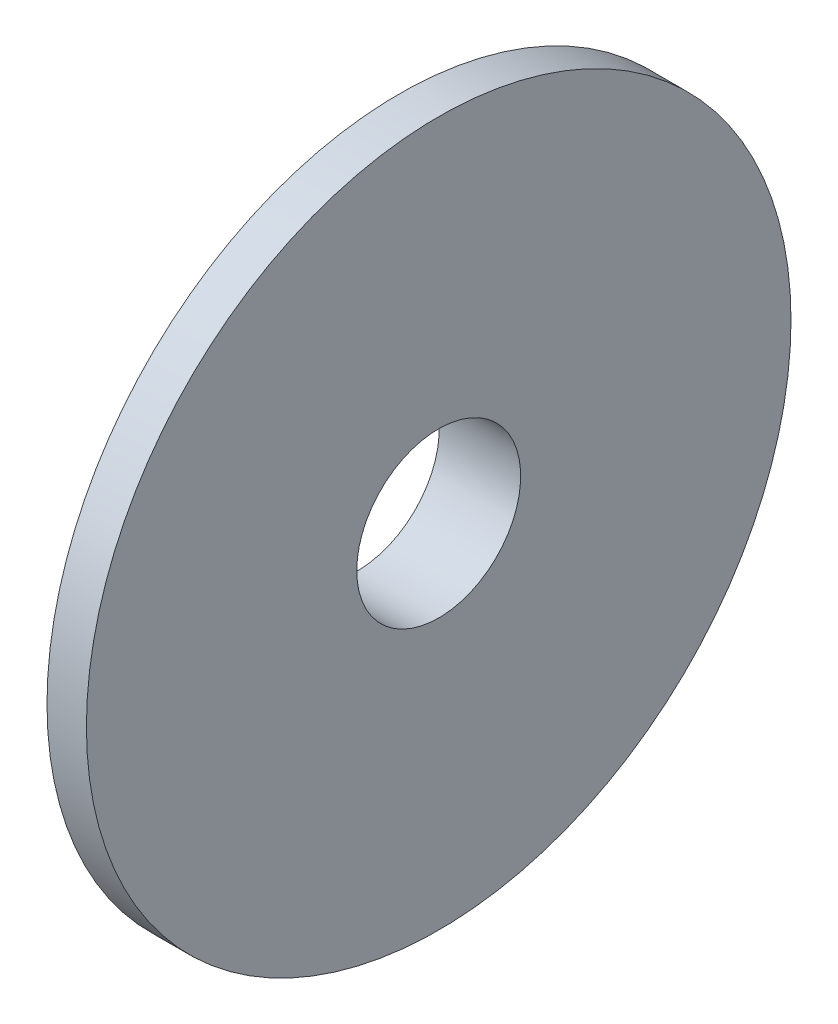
ISO-10303-21;
HEADER;
FILE_DESCRIPTION(('STEP AP214'),'2;1');
FILE_NAME('part.step','',(''),(''),'','','');
FILE_SCHEMA(('AUTOMOTIVE_DESIGN { 1 0 10303 214 1 1 1 1 }'));
ENDSEC;
DATA;
#1=APPLICATION_CONTEXT('core data for automotive mechanical design processes');
#2=APPLICATION_PROTOCOL_DEFINITION('international standard','automotive_design',2000,#1);
#3=PRODUCT_CONTEXT('',#1,'mechanical');
#4=PRODUCT('Part','Part','',(#3));
#5=PRODUCT_RELATED_PRODUCT_CATEGORY('part','',(#4));
#6=PRODUCT_DEFINITION_FORMATION('','',#4);
#7=PRODUCT_DEFINITION_CONTEXT('part definition',#1,'design');
#8=PRODUCT_DEFINITION('design','',#6,#7);
#9=PRODUCT_DEFINITION_SHAPE('','',#8);
#10=(LENGTH_UNIT() NAMED_UNIT(*) SI_UNIT(.MILLI.,.METRE.));
#11=(NAMED_UNIT(*) PLANE_ANGLE_UNIT() SI_UNIT($,.RADIAN.));
#12=(NAMED_UNIT(*) SI_UNIT($,.STERADIAN.) SOLID_ANGLE_UNIT());
#13=UNCERTAINTY_MEASURE_WITH_UNIT(LENGTH_MEASURE(1.E-05),#10,'distance_accuracy_value','');
#14=(GEOMETRIC_REPRESENTATION_CONTEXT(3) GLOBAL_UNCERTAINTY_ASSIGNED_CONTEXT((#13)) GLOBAL_UNIT_ASSIGNED_CONTEXT((#10,
#11,#12)) REPRESENTATION_CONTEXT('',''));
#15=CARTESIAN_POINT('',(0.,0.,0.));
#16=DIRECTION('',(0.,0.,1.));
#17=DIRECTION('',(1.,0.,0.));
#18=AXIS2_PLACEMENT_3D('',#15,#16,#17);
#19=CARTESIAN_POINT('',(0.,0.,0.));
#20=DIRECTION('',(-1.,0.,0.));
#21=DIRECTION('',(0.,0.,1.));
#22=AXIS2_PLACEMENT_3D('',#19,#20,#21);
#23=CYLINDRICAL_SURFACE('',#22,5.2);
#24=CARTESIAN_POINT('',(5.165,0.,0.));
#25=DIRECTION('',(-1.,0.,0.));
#26=DIRECTION('',(0.,0.,1.));
#27=AXIS2_PLACEMENT_3D('',#24,#25,#26);
#28=CIRCLE('',#27,5.2);
#29=CARTESIAN_POINT('',(5.165,0.,5.2));
#30=VERTEX_POINT('',#29);
#31=EDGE_CURVE('E51',#30,#30,#28,.T.);
#32=ORIENTED_EDGE('',*,*,#31,.F.);
#33=EDGE_LOOP('',(#32));
#34=FACE_BOUND('',#33,.T.);
#35=CARTESIAN_POINT('',(0.,0.,0.));
#36=DIRECTION('',(-1.,0.,0.));
#37=DIRECTION('',(0.,0.,1.));
#38=AXIS2_PLACEMENT_3D('',#35,#36,#37);
#39=CIRCLE('',#38,5.2);
#40=CARTESIAN_POINT('',(0.,0.,5.2));
#41=VERTEX_POINT('',#40);
#42=EDGE_CURVE('E10',#41,#41,#39,.T.);
#43=ORIENTED_EDGE('',*,*,#42,.T.);
#44=EDGE_LOOP('',(#43));
#45=FACE_BOUND('',#44,.T.);
#46=ADVANCED_FACE('F32',(#34,#45),#23,.F.);
#47=CARTESIAN_POINT('',(0.,5.2,0.));
#48=DIRECTION('',(1.,0.,0.));
#49=DIRECTION('',(0.,0.,-1.));
#50=AXIS2_PLACEMENT_3D('',#47,#48,#49);
#51=PLANE('',#50);
#52=ORIENTED_EDGE('',*,*,#42,.F.);
#53=EDGE_LOOP('',(#52));
#54=FACE_BOUND('',#53,.T.);
#55=CARTESIAN_POINT('',(0.,0.,0.));
#56=DIRECTION('',(-1.,0.,0.));
#57=DIRECTION('',(0.,0.,1.));
#58=AXIS2_PLACEMENT_3D('',#55,#56,#57);
#59=CIRCLE('',#58,10.);
#60=CARTESIAN_POINT('',(0.,0.,10.));
#61=VERTEX_POINT('',#60);
#62=EDGE_CURVE('E38',#61,#61,#59,.T.);
#63=ORIENTED_EDGE('',*,*,#62,.T.);
#64=EDGE_LOOP('',(#63));
#65=FACE_BOUND('',#64,.T.);
#66=ADVANCED_FACE('F58',(#54,#65),#51,.F.);
#67=CARTESIAN_POINT('',(2.665,0.,0.));
#68=DIRECTION('',(1.,0.,0.));
#69=DIRECTION('',(0.,0.,-1.));
#70=AXIS2_PLACEMENT_3D('',#67,#68,#69);
#71=CONICAL_SURFACE('',#70,22.35,1.3582656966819);
#72=ORIENTED_EDGE('',*,*,#62,.F.);
#73=EDGE_LOOP('',(#72));
#74=FACE_BOUND('',#73,.T.);
#75=CARTESIAN_POINT('',(2.665,0.,0.));
#76=DIRECTION('',(-1.,0.,0.));
#77=DIRECTION('',(0.,0.,1.));
#78=AXIS2_PLACEMENT_3D('',#75,#76,#77);
#79=CIRCLE('',#78,22.35);
#80=CARTESIAN_POINT('',(2.665,0.,22.35));
#81=VERTEX_POINT('',#80);
#82=EDGE_CURVE('E42',#81,#81,#79,.T.);
#83=ORIENTED_EDGE('',*,*,#82,.T.);
#84=EDGE_LOOP('',(#83));
#85=FACE_BOUND('',#84,.T.);
#86=ADVANCED_FACE('F62',(#74,#85),#71,.T.);
#87=CARTESIAN_POINT('',(0.,0.,0.));
#88=DIRECTION('',(-1.,0.,0.));
#89=DIRECTION('',(0.,0.,1.));
#90=AXIS2_PLACEMENT_3D('',#87,#88,#89);
#91=CYLINDRICAL_SURFACE('',#90,22.35);
#92=ORIENTED_EDGE('',*,*,#82,.F.);
#93=EDGE_LOOP('',(#92));
#94=FACE_BOUND('',#93,.T.);
#95=CARTESIAN_POINT('',(5.165,0.,0.));
#96=DIRECTION('',(-1.,0.,0.));
#97=DIRECTION('',(0.,0.,1.));
#98=AXIS2_PLACEMENT_3D('',#95,#96,#97);
#99=CIRCLE('',#98,22.35);
#100=CARTESIAN_POINT('',(5.165,0.,22.35));
#101=VERTEX_POINT('',#100);
#102=EDGE_CURVE('E46',#101,#101,#99,.T.);
#103=ORIENTED_EDGE('',*,*,#102,.T.);
#104=EDGE_LOOP('',(#103));
#105=FACE_BOUND('',#104,.T.);
#106=ADVANCED_FACE('F67',(#94,#105),#91,.T.);
#107=CARTESIAN_POINT('',(5.165,22.35,0.));
#108=DIRECTION('',(-1.,0.,0.));
#109=DIRECTION('',(0.,0.,1.));
#110=AXIS2_PLACEMENT_3D('',#107,#108,#109);
#111=PLANE('',#110);
#112=ORIENTED_EDGE('',*,*,#102,.F.);
#113=EDGE_LOOP('',(#112));
#114=FACE_BOUND('',#113,.T.);
#115=ORIENTED_EDGE('',*,*,#31,.T.);
#116=EDGE_LOOP('',(#115));
#117=FACE_BOUND('',#116,.T.);
#118=ADVANCED_FACE('F55',(#114,#117),#111,.F.);
#119=CLOSED_SHELL('',(#46,#66,#86,#106,#118));
#120=MANIFOLD_SOLID_BREP('B2',#119);
#121=ADVANCED_BREP_SHAPE_REPRESENTATION('',(#18,#120),#14);
#122=SHAPE_DEFINITION_REPRESENTATION(#9,#121);
ENDSEC;
END-ISO-10303-21;
